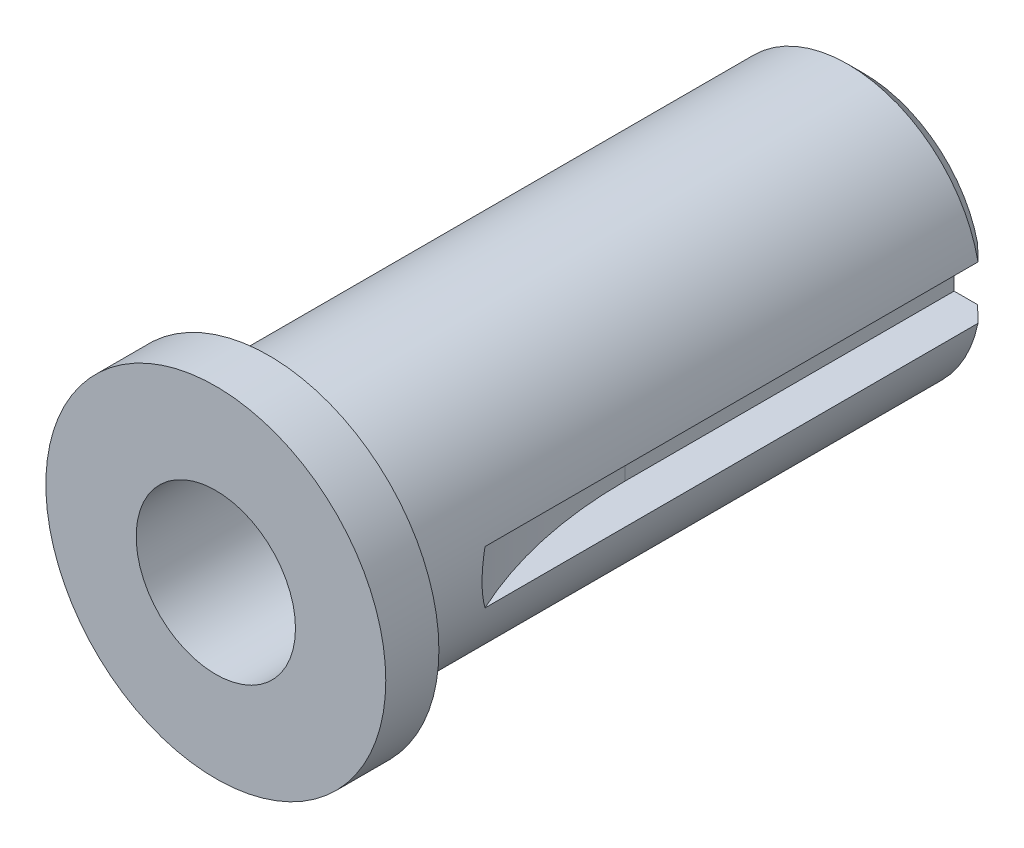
ISO-10303-21;
HEADER;
FILE_DESCRIPTION(('STEP AP214'),'2;1');
FILE_NAME('part.step','',(''),(''),'','','');
FILE_SCHEMA(('AUTOMOTIVE_DESIGN { 1 0 10303 214 1 1 1 1 }'));
ENDSEC;
DATA;
#1=APPLICATION_CONTEXT('core data for automotive mechanical design processes');
#2=APPLICATION_PROTOCOL_DEFINITION('international standard','automotive_design',2000,#1);
#3=PRODUCT_CONTEXT('',#1,'mechanical');
#4=PRODUCT('Part','Part','',(#3));
#5=PRODUCT_RELATED_PRODUCT_CATEGORY('part','',(#4));
#6=PRODUCT_DEFINITION_FORMATION('','',#4);
#7=PRODUCT_DEFINITION_CONTEXT('part definition',#1,'design');
#8=PRODUCT_DEFINITION('design','',#6,#7);
#9=PRODUCT_DEFINITION_SHAPE('','',#8);
#10=(LENGTH_UNIT() NAMED_UNIT(*) SI_UNIT(.MILLI.,.METRE.));
#11=(NAMED_UNIT(*) PLANE_ANGLE_UNIT() SI_UNIT($,.RADIAN.));
#12=(NAMED_UNIT(*) SI_UNIT($,.STERADIAN.) SOLID_ANGLE_UNIT());
#13=UNCERTAINTY_MEASURE_WITH_UNIT(LENGTH_MEASURE(1.E-05),#10,'distance_accuracy_value','');
#14=(GEOMETRIC_REPRESENTATION_CONTEXT(3) GLOBAL_UNCERTAINTY_ASSIGNED_CONTEXT((#13)) GLOBAL_UNIT_ASSIGNED_CONTEXT((#10,
#11,#12)) REPRESENTATION_CONTEXT('',''));
#15=CARTESIAN_POINT('',(0.,0.,0.));
#16=DIRECTION('',(0.,0.,1.));
#17=DIRECTION('',(1.,0.,0.));
#18=AXIS2_PLACEMENT_3D('',#15,#16,#17);
#19=CARTESIAN_POINT('',(0.,0.,56.));
#20=DIRECTION('',(0.,0.,-1.));
#21=DIRECTION('',(-1.,0.,0.));
#22=AXIS2_PLACEMENT_3D('',#19,#20,#21);
#23=CYLINDRICAL_SURFACE('',#22,12.5);
#24=CARTESIAN_POINT('',(12.2474487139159,-2.50000000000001,47.9042161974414));
#25=CARTESIAN_POINT('',(12.2771281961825,-2.35468268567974,47.9678597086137));
#26=CARTESIAN_POINT('',(12.3046364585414,-2.20664219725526,48.0264218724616));
#27=CARTESIAN_POINT('',(12.3547995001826,-1.90580453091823,48.1326588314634));
#28=CARTESIAN_POINT('',(12.377451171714,-1.75300437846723,48.1803266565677));
#29=CARTESIAN_POINT('',(12.4173191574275,-1.4437696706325,48.2639008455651));
#30=CARTESIAN_POINT('',(12.4345440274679,-1.28734125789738,48.2998257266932));
#31=CARTESIAN_POINT('',(12.4631838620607,-0.971673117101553,48.3594061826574));
#32=CARTESIAN_POINT('',(12.4746002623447,-0.812434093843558,48.3830647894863));
#33=CARTESIAN_POINT('',(12.4913699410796,-0.491533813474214,48.4177764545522));
#34=CARTESIAN_POINT('',(12.4966956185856,-0.32986486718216,48.4287721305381));
#35=CARTESIAN_POINT('',(12.5010470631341,-0.00608277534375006,48.4377582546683));
#36=CARTESIAN_POINT('',(12.5000728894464,0.156030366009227,48.4357488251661));
#37=CARTESIAN_POINT('',(12.4918517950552,0.479343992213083,48.4187643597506));
#38=CARTESIAN_POINT('',(12.4846077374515,0.640544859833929,48.4037952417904));
#39=CARTESIAN_POINT('',(12.4640531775,0.960804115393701,48.3611948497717));
#40=CARTESIAN_POINT('',(12.4507441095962,1.11986300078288,48.333566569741));
#41=CARTESIAN_POINT('',(12.4128736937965,1.48846530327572,48.254618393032));
#42=CARTESIAN_POINT('',(12.3860240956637,1.69675987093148,48.1984349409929));
#43=CARTESIAN_POINT('',(12.3389168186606,2.00295526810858,48.0990463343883));
#44=CARTESIAN_POINT('',(12.3220831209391,2.10394286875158,48.0634139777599));
#45=CARTESIAN_POINT('',(12.2863069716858,2.30367973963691,47.9873542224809));
#46=CARTESIAN_POINT('',(12.2673651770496,2.40242969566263,47.9469283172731));
#47=CARTESIAN_POINT('',(12.2474487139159,2.49999999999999,47.9042161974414));
#48=B_SPLINE_CURVE_WITH_KNOTS('',3,(#24,#25,#26,#27,#28,#29,#30,#31,#32,#33,#34,#35,#36,#37,#38,
#39,#40,#41,#42,#43,#44,#45,#46,#47),.UNSPECIFIED.,.F.,.F.,(4,2,2,2,2,2,2,2,2,2,2,4),(0.,
0.484143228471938,0.968595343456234,1.45227980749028,1.93584465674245,2.42159226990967,
2.90733531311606,3.39285666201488,3.87826323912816,4.52892981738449,4.8540210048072,
5.17901117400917),.UNSPECIFIED.);
#49=CARTESIAN_POINT('',(12.2474487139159,-2.50000000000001,47.9042161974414));
#50=VERTEX_POINT('',#49);
#51=CARTESIAN_POINT('',(12.2474487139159,2.49999999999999,47.9042161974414));
#52=VERTEX_POINT('',#51);
#53=EDGE_CURVE('E12',#50,#52,#48,.T.);
#54=ORIENTED_EDGE('',*,*,#53,.T.);
#55=DIRECTION('',(0.,0.,-1.));
#56=VECTOR('',#55,1.);
#57=CARTESIAN_POINT('',(12.2474487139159,2.49999999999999,56.));
#58=LINE('',#57,#56);
#59=CARTESIAN_POINT('',(12.2474487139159,2.49999999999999,1.5));
#60=VERTEX_POINT('',#59);
#61=EDGE_CURVE('E94',#52,#60,#58,.T.);
#62=ORIENTED_EDGE('',*,*,#61,.T.);
#63=CARTESIAN_POINT('',(0.,0.,1.5));
#64=DIRECTION('',(0.,0.,1.));
#65=DIRECTION('',(1.,0.,0.));
#66=AXIS2_PLACEMENT_3D('',#63,#64,#65);
#67=CIRCLE('',#66,12.5);
#68=CARTESIAN_POINT('',(12.2474487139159,-2.50000000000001,1.5));
#69=VERTEX_POINT('',#68);
#70=EDGE_CURVE('E141',#60,#69,#67,.T.);
#71=ORIENTED_EDGE('',*,*,#70,.T.);
#72=DIRECTION('',(0.,0.,-1.));
#73=VECTOR('',#72,1.);
#74=CARTESIAN_POINT('',(12.2474487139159,-2.50000000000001,56.));
#75=LINE('',#74,#73);
#76=EDGE_CURVE('E56',#50,#69,#75,.T.);
#77=ORIENTED_EDGE('',*,*,#76,.F.);
#78=EDGE_LOOP('',(#54,#62,#71,#77));
#79=FACE_BOUND('',#78,.T.);
#80=CARTESIAN_POINT('',(0.,0.,56.));
#81=DIRECTION('',(0.,0.,1.));
#82=DIRECTION('',(1.,0.,0.));
#83=AXIS2_PLACEMENT_3D('',#80,#81,#82);
#84=CIRCLE('',#83,12.5);
#85=CARTESIAN_POINT('',(12.5,0.,56.));
#86=VERTEX_POINT('',#85);
#87=EDGE_CURVE('E135',#86,#86,#84,.T.);
#88=ORIENTED_EDGE('',*,*,#87,.F.);
#89=EDGE_LOOP('',(#88));
#90=FACE_BOUND('',#89,.T.);
#91=ADVANCED_FACE('F36',(#79,#90),#23,.T.);
#92=CARTESIAN_POINT('',(0.,0.,0.));
#93=DIRECTION('',(0.,0.,1.));
#94=DIRECTION('',(1.,0.,0.));
#95=AXIS2_PLACEMENT_3D('',#92,#93,#94);
#96=PLANE('',#95);
#97=CARTESIAN_POINT('',(0.,0.,0.));
#98=DIRECTION('',(0.,0.,1.));
#99=DIRECTION('',(1.,0.,0.));
#100=AXIS2_PLACEMENT_3D('',#97,#98,#99);
#101=CIRCLE('',#100,11.);
#102=CARTESIAN_POINT('',(10.7121426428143,-2.50000000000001,0.));
#103=VERTEX_POINT('',#102);
#104=CARTESIAN_POINT('',(10.7121426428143,2.49999999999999,0.));
#105=VERTEX_POINT('',#104);
#106=EDGE_CURVE('E144',#103,#105,#101,.F.);
#107=ORIENTED_EDGE('',*,*,#106,.T.);
#108=DIRECTION('',(-1.,0.,0.));
#109=VECTOR('',#108,1.);
#110=CARTESIAN_POINT('',(0.,2.5,0.));
#111=LINE('',#110,#109);
#112=CARTESIAN_POINT('',(8.5,2.5,0.));
#113=VERTEX_POINT('',#112);
#114=EDGE_CURVE('E116',#105,#113,#111,.T.);
#115=ORIENTED_EDGE('',*,*,#114,.T.);
#116=DIRECTION('',(0.,-1.,0.));
#117=VECTOR('',#116,1.);
#118=CARTESIAN_POINT('',(8.5,0.,0.));
#119=LINE('',#118,#117);
#120=CARTESIAN_POINT('',(8.5,-2.5,0.));
#121=VERTEX_POINT('',#120);
#122=EDGE_CURVE('E49',#113,#121,#119,.T.);
#123=ORIENTED_EDGE('',*,*,#122,.T.);
#124=DIRECTION('',(-1.,0.,0.));
#125=VECTOR('',#124,1.);
#126=CARTESIAN_POINT('',(0.,-2.5,0.));
#127=LINE('',#126,#125);
#128=EDGE_CURVE('E106',#103,#121,#127,.T.);
#129=ORIENTED_EDGE('',*,*,#128,.F.);
#130=EDGE_LOOP('',(#107,#115,#123,#129));
#131=FACE_BOUND('',#130,.T.);
#132=CARTESIAN_POINT('',(0.,0.,0.));
#133=DIRECTION('',(0.,0.,1.));
#134=DIRECTION('',(1.,0.,0.));
#135=AXIS2_PLACEMENT_3D('',#132,#133,#134);
#136=CIRCLE('',#135,5.915);
#137=CARTESIAN_POINT('',(5.915,0.,0.));
#138=VERTEX_POINT('',#137);
#139=EDGE_CURVE('E120',#138,#138,#136,.T.);
#140=ORIENTED_EDGE('',*,*,#139,.T.);
#141=EDGE_LOOP('',(#140));
#142=FACE_BOUND('',#141,.T.);
#143=ADVANCED_FACE('F186',(#131,#142),#96,.F.);
#144=CARTESIAN_POINT('',(0.,0.,56.));
#145=DIRECTION('',(0.,0.,1.));
#146=DIRECTION('',(1.,0.,0.));
#147=AXIS2_PLACEMENT_3D('',#144,#145,#146);
#148=PLANE('',#147);
#149=CARTESIAN_POINT('',(0.,0.,56.));
#150=DIRECTION('',(0.,0.,1.));
#151=DIRECTION('',(1.,0.,0.));
#152=AXIS2_PLACEMENT_3D('',#149,#150,#151);
#153=CIRCLE('',#152,16.);
#154=CARTESIAN_POINT('',(16.,0.,56.));
#155=VERTEX_POINT('',#154);
#156=EDGE_CURVE('E131',#155,#155,#153,.T.);
#157=ORIENTED_EDGE('',*,*,#156,.F.);
#158=EDGE_LOOP('',(#157));
#159=FACE_BOUND('',#158,.T.);
#160=ORIENTED_EDGE('',*,*,#87,.T.);
#161=EDGE_LOOP('',(#160));
#162=FACE_BOUND('',#161,.T.);
#163=ADVANCED_FACE('F183',(#159,#162),#148,.F.);
#164=CARTESIAN_POINT('',(0.,0.,61.));
#165=DIRECTION('',(0.,0.,-1.));
#166=DIRECTION('',(-1.,0.,0.));
#167=AXIS2_PLACEMENT_3D('',#164,#165,#166);
#168=CYLINDRICAL_SURFACE('',#167,16.);
#169=CARTESIAN_POINT('',(0.,0.,61.));
#170=DIRECTION('',(0.,0.,1.));
#171=DIRECTION('',(1.,0.,0.));
#172=AXIS2_PLACEMENT_3D('',#169,#170,#171);
#173=CIRCLE('',#172,16.);
#174=CARTESIAN_POINT('',(16.,0.,61.));
#175=VERTEX_POINT('',#174);
#176=EDGE_CURVE('E132',#175,#175,#173,.T.);
#177=ORIENTED_EDGE('',*,*,#176,.F.);
#178=EDGE_LOOP('',(#177));
#179=FACE_BOUND('',#178,.T.);
#180=ORIENTED_EDGE('',*,*,#156,.T.);
#181=EDGE_LOOP('',(#180));
#182=FACE_BOUND('',#181,.T.);
#183=ADVANCED_FACE('F181',(#179,#182),#168,.T.);
#184=CARTESIAN_POINT('',(0.,0.,61.));
#185=DIRECTION('',(0.,0.,1.));
#186=DIRECTION('',(1.,0.,0.));
#187=AXIS2_PLACEMENT_3D('',#184,#185,#186);
#188=PLANE('',#187);
#189=CARTESIAN_POINT('',(0.,0.,61.));
#190=DIRECTION('',(0.,0.,1.));
#191=DIRECTION('',(1.,0.,0.));
#192=AXIS2_PLACEMENT_3D('',#189,#190,#191);
#193=CIRCLE('',#192,7.5);
#194=CARTESIAN_POINT('',(7.5,0.,61.));
#195=VERTEX_POINT('',#194);
#196=EDGE_CURVE('E123',#195,#195,#193,.T.);
#197=ORIENTED_EDGE('',*,*,#196,.F.);
#198=EDGE_LOOP('',(#197));
#199=FACE_BOUND('',#198,.T.);
#200=ORIENTED_EDGE('',*,*,#176,.T.);
#201=EDGE_LOOP('',(#200));
#202=FACE_BOUND('',#201,.T.);
#203=ADVANCED_FACE('F177',(#199,#202),#188,.T.);
#204=CARTESIAN_POINT('',(0.,0.,-21.2132034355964));
#205=DIRECTION('',(0.,0.,1.));
#206=DIRECTION('',(1.,0.,0.));
#207=AXIS2_PLACEMENT_3D('',#204,#205,#206);
#208=CYLINDRICAL_SURFACE('',#207,7.5);
#209=CARTESIAN_POINT('',(0.,0.,25.));
#210=DIRECTION('',(0.,0.,1.));
#211=DIRECTION('',(1.,0.,0.));
#212=AXIS2_PLACEMENT_3D('',#209,#210,#211);
#213=CIRCLE('',#212,7.5);
#214=CARTESIAN_POINT('',(7.5,0.,25.));
#215=VERTEX_POINT('',#214);
#216=EDGE_CURVE('E128',#215,#215,#213,.F.);
#217=ORIENTED_EDGE('',*,*,#216,.T.);
#218=EDGE_LOOP('',(#217));
#219=FACE_BOUND('',#218,.T.);
#220=ORIENTED_EDGE('',*,*,#196,.T.);
#221=EDGE_LOOP('',(#220));
#222=FACE_BOUND('',#221,.T.);
#223=ADVANCED_FACE('F173',(#219,#222),#208,.F.);
#224=CARTESIAN_POINT('',(0.,0.,25.));
#225=DIRECTION('',(0.,0.,1.));
#226=DIRECTION('',(1.,0.,0.));
#227=AXIS2_PLACEMENT_3D('',#224,#225,#226);
#228=PLANE('',#227);
#229=CARTESIAN_POINT('',(0.,0.,25.));
#230=DIRECTION('',(0.,0.,1.));
#231=DIRECTION('',(1.,0.,0.));
#232=AXIS2_PLACEMENT_3D('',#229,#230,#231);
#233=CIRCLE('',#232,5.915);
#234=CARTESIAN_POINT('',(5.915,0.,25.));
#235=VERTEX_POINT('',#234);
#236=EDGE_CURVE('E119',#235,#235,#233,.T.);
#237=ORIENTED_EDGE('',*,*,#236,.F.);
#238=EDGE_LOOP('',(#237));
#239=FACE_BOUND('',#238,.T.);
#240=ORIENTED_EDGE('',*,*,#216,.F.);
#241=EDGE_LOOP('',(#240));
#242=FACE_BOUND('',#241,.T.);
#243=ADVANCED_FACE('F169',(#239,#242),#228,.T.);
#244=CARTESIAN_POINT('',(0.,0.,0.));
#245=DIRECTION('',(0.,0.,1.));
#246=DIRECTION('',(1.,0.,0.));
#247=AXIS2_PLACEMENT_3D('',#244,#245,#246);
#248=CYLINDRICAL_SURFACE('',#247,5.915);
#249=ORIENTED_EDGE('',*,*,#139,.F.);
#250=EDGE_LOOP('',(#249));
#251=FACE_BOUND('',#250,.T.);
#252=ORIENTED_EDGE('',*,*,#236,.T.);
#253=EDGE_LOOP('',(#252));
#254=FACE_BOUND('',#253,.T.);
#255=ADVANCED_FACE('F166',(#251,#254),#248,.F.);
#256=CARTESIAN_POINT('',(0.,0.,1.5));
#257=DIRECTION('',(0.,0.,1.));
#258=DIRECTION('',(1.,0.,0.));
#259=AXIS2_PLACEMENT_3D('',#256,#257,#258);
#260=CONICAL_SURFACE('',#259,12.5,0.785398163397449);
#261=CARTESIAN_POINT('',(5.07867915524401,2.5,-5.33934792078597));
#262=CARTESIAN_POINT('',(5.28442984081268,2.5,-5.15468284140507));
#263=CARTESIAN_POINT('',(5.48915692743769,2.5,-4.96888696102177));
#264=CARTESIAN_POINT('',(5.89697528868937,2.5,-4.59551868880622));
#265=CARTESIAN_POINT('',(6.10006660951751,2.5,-4.40794634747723));
#266=CARTESIAN_POINT('',(6.5050231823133,2.5,-4.03151204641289));
#267=CARTESIAN_POINT('',(6.7068885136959,2.5,-3.842650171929));
#268=CARTESIAN_POINT('',(7.10966592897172,2.5,-3.46390990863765));
#269=CARTESIAN_POINT('',(7.31057800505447,2.5,-3.2740315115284));
#270=CARTESIAN_POINT('',(7.91215017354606,2.5,-2.70325516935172));
#271=CARTESIAN_POINT('',(8.31168906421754,2.5,-2.32117604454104));
#272=CARTESIAN_POINT('',(9.10881196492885,2.5,-1.55497623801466));
#273=CARTESIAN_POINT('',(9.50639594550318,2.49999999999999,-1.17085552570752));
#274=CARTESIAN_POINT('',(10.1255626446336,2.49999999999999,-0.570518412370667));
#275=CARTESIAN_POINT('',(10.3476162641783,2.49999999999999,-0.354787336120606));
#276=CARTESIAN_POINT('',(10.7913663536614,2.49999999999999,0.077047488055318));
#277=CARTESIAN_POINT('',(11.0130628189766,2.49999999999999,0.293151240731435));
#278=CARTESIAN_POINT('',(11.740952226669,2.49999999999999,1.00365753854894));
#279=CARTESIAN_POINT('',(12.2465154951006,2.49999999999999,1.49870513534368));
#280=CARTESIAN_POINT('',(13.2565687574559,2.49999999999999,2.48989441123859));
#281=CARTESIAN_POINT('',(13.7610587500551,2.49999999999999,2.98603609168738));
#282=CARTESIAN_POINT('',(14.7692373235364,2.49999999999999,3.97907730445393));
#283=CARTESIAN_POINT('',(15.2729259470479,2.49999999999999,4.47597679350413));
#284=CARTESIAN_POINT('',(16.2797133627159,2.49999999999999,5.47036959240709));
#285=CARTESIAN_POINT('',(16.7828121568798,2.49999999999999,5.96786290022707));
#286=CARTESIAN_POINT('',(17.2857096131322,2.49999999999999,6.46555916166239));
#287=B_SPLINE_CURVE_WITH_KNOTS('',3,(#261,#262,#263,#264,#265,#266,#267,#268,#269,#270,#271,
#272,#273,#274,#275,#276,#277,#278,#279,#280,#281,#282,#283,#284,#285,#286),.UNSPECIFIED.,.F.,
.F.,(4,2,2,2,2,2,2,2,2,2,2,2,4),(0.,0.829390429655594,1.65875735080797,2.48806996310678,
3.31738935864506,4.97585222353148,6.63434000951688,7.56311801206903,8.49190794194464,
10.6146385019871,12.7373716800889,14.8599878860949,16.9825968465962),.UNSPECIFIED.);
#288=EDGE_CURVE('E64',#105,#60,#287,.T.);
#289=ORIENTED_EDGE('',*,*,#288,.F.);
#290=ORIENTED_EDGE('',*,*,#106,.F.);
#291=CARTESIAN_POINT('',(5.07867915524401,-2.5,-5.33934792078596));
#292=CARTESIAN_POINT('',(5.28442984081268,-2.5,-5.15468284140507));
#293=CARTESIAN_POINT('',(5.4891569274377,-2.5,-4.96888696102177));
#294=CARTESIAN_POINT('',(5.89697528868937,-2.5,-4.59551868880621));
#295=CARTESIAN_POINT('',(6.10006660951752,-2.5,-4.40794634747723));
#296=CARTESIAN_POINT('',(6.50502318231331,-2.5,-4.03151204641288));
#297=CARTESIAN_POINT('',(6.70688851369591,-2.5,-3.84265017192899));
#298=CARTESIAN_POINT('',(7.10966592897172,-2.5,-3.46390990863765));
#299=CARTESIAN_POINT('',(7.31057800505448,-2.5,-3.2740315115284));
#300=CARTESIAN_POINT('',(7.91215017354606,-2.5,-2.70325516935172));
#301=CARTESIAN_POINT('',(8.31168906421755,-2.5,-2.32117604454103));
#302=CARTESIAN_POINT('',(9.10881196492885,-2.5,-1.55497623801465));
#303=CARTESIAN_POINT('',(9.50639594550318,-2.50000000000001,-1.17085552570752));
#304=CARTESIAN_POINT('',(10.1255626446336,-2.50000000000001,-0.570518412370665));
#305=CARTESIAN_POINT('',(10.3476162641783,-2.50000000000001,-0.354787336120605));
#306=CARTESIAN_POINT('',(10.7913663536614,-2.50000000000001,0.0770474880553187));
#307=CARTESIAN_POINT('',(11.0130628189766,-2.50000000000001,0.293151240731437));
#308=CARTESIAN_POINT('',(11.740952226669,-2.50000000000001,1.00365753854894));
#309=CARTESIAN_POINT('',(12.2465154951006,-2.50000000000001,1.49870513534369));
#310=CARTESIAN_POINT('',(13.2565687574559,-2.50000000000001,2.4898944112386));
#311=CARTESIAN_POINT('',(13.7610587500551,-2.50000000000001,2.98603609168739));
#312=CARTESIAN_POINT('',(14.7692373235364,-2.50000000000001,3.97907730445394));
#313=CARTESIAN_POINT('',(15.2729259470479,-2.50000000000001,4.47597679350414));
#314=CARTESIAN_POINT('',(16.2797133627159,-2.50000000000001,5.4703695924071));
#315=CARTESIAN_POINT('',(16.7828121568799,-2.50000000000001,5.96786290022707));
#316=CARTESIAN_POINT('',(17.2857096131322,-2.50000000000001,6.46555916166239));
#317=B_SPLINE_CURVE_WITH_KNOTS('',3,(#291,#292,#293,#294,#295,#296,#297,#298,#299,#300,#301,
#302,#303,#304,#305,#306,#307,#308,#309,#310,#311,#312,#313,#314,#315,#316),.UNSPECIFIED.,.F.,
.F.,(4,2,2,2,2,2,2,2,2,2,2,2,4),(0.,0.829390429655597,1.65875735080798,2.48806996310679,
3.31738935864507,4.97585222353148,6.63434000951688,7.56311801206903,8.49190794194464,
10.6146385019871,12.7373716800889,14.8599878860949,16.9825968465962),.UNSPECIFIED.);
#318=EDGE_CURVE('E147',#103,#69,#317,.T.);
#319=ORIENTED_EDGE('',*,*,#318,.T.);
#320=ORIENTED_EDGE('',*,*,#70,.F.);
#321=EDGE_LOOP('',(#289,#290,#319,#320));
#322=FACE_BOUND('',#321,.T.);
#323=ADVANCED_FACE('F38',(#322),#260,.T.);
#324=CARTESIAN_POINT('',(48.5,2.49999999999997,31.));
#325=DIRECTION('',(0.,-1.,0.));
#326=DIRECTION('',(1.,0.,0.));
#327=AXIS2_PLACEMENT_3D('',#324,#325,#326);
#328=CYLINDRICAL_SURFACE('',#327,40.);
#329=CARTESIAN_POINT('',(48.5,-2.50000000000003,31.));
#330=DIRECTION('',(0.,-1.,0.));
#331=DIRECTION('',(-1.,0.,0.));
#332=AXIS2_PLACEMENT_3D('',#329,#330,#331);
#333=CIRCLE('',#332,40.);
#334=CARTESIAN_POINT('',(8.5,-2.5,31.));
#335=VERTEX_POINT('',#334);
#336=EDGE_CURVE('E102',#50,#335,#333,.T.);
#337=ORIENTED_EDGE('',*,*,#336,.T.);
#338=DIRECTION('',(0.,-1.,0.));
#339=VECTOR('',#338,1.);
#340=CARTESIAN_POINT('',(8.5,2.5,31.));
#341=LINE('',#340,#339);
#342=CARTESIAN_POINT('',(8.5,2.5,31.));
#343=VERTEX_POINT('',#342);
#344=EDGE_CURVE('E100',#343,#335,#341,.T.);
#345=ORIENTED_EDGE('',*,*,#344,.F.);
#346=CARTESIAN_POINT('',(48.5,2.49999999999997,31.));
#347=DIRECTION('',(0.,-1.,0.));
#348=DIRECTION('',(-1.,0.,0.));
#349=AXIS2_PLACEMENT_3D('',#346,#347,#348);
#350=CIRCLE('',#349,40.);
#351=EDGE_CURVE('E88',#52,#343,#350,.T.);
#352=ORIENTED_EDGE('',*,*,#351,.F.);
#353=ORIENTED_EDGE('',*,*,#53,.F.);
#354=EDGE_LOOP('',(#337,#345,#352,#353));
#355=FACE_BOUND('',#354,.T.);
#356=ADVANCED_FACE('F101',(#355),#328,.F.);
#357=CARTESIAN_POINT('',(8.5,2.5,31.));
#358=DIRECTION('',(-1.,0.,0.));
#359=DIRECTION('',(0.,-1.,0.));
#360=AXIS2_PLACEMENT_3D('',#357,#358,#359);
#361=PLANE('',#360);
#362=DIRECTION('',(0.,0.,-1.));
#363=VECTOR('',#362,1.);
#364=CARTESIAN_POINT('',(8.5,2.5,31.));
#365=LINE('',#364,#363);
#366=EDGE_CURVE('E92',#343,#113,#365,.T.);
#367=ORIENTED_EDGE('',*,*,#366,.F.);
#368=ORIENTED_EDGE('',*,*,#344,.T.);
#369=DIRECTION('',(0.,0.,-1.));
#370=VECTOR('',#369,1.);
#371=CARTESIAN_POINT('',(8.5,-2.5,31.));
#372=LINE('',#371,#370);
#373=EDGE_CURVE('E97',#335,#121,#372,.T.);
#374=ORIENTED_EDGE('',*,*,#373,.T.);
#375=ORIENTED_EDGE('',*,*,#122,.F.);
#376=EDGE_LOOP('',(#367,#368,#374,#375));
#377=FACE_BOUND('',#376,.T.);
#378=ADVANCED_FACE('F108',(#377),#361,.F.);
#379=CARTESIAN_POINT('',(48.5,2.49999999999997,31.));
#380=DIRECTION('',(0.,1.,0.));
#381=DIRECTION('',(-1.,0.,0.));
#382=AXIS2_PLACEMENT_3D('',#379,#380,#381);
#383=PLANE('',#382);
#384=ORIENTED_EDGE('',*,*,#351,.T.);
#385=ORIENTED_EDGE('',*,*,#366,.T.);
#386=ORIENTED_EDGE('',*,*,#114,.F.);
#387=ORIENTED_EDGE('',*,*,#288,.T.);
#388=ORIENTED_EDGE('',*,*,#61,.F.);
#389=EDGE_LOOP('',(#384,#385,#386,#387,#388));
#390=FACE_BOUND('',#389,.T.);
#391=ADVANCED_FACE('F90',(#390),#383,.F.);
#392=CARTESIAN_POINT('',(48.5,-2.50000000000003,31.));
#393=DIRECTION('',(0.,1.,0.));
#394=DIRECTION('',(-1.,0.,0.));
#395=AXIS2_PLACEMENT_3D('',#392,#393,#394);
#396=PLANE('',#395);
#397=ORIENTED_EDGE('',*,*,#76,.T.);
#398=ORIENTED_EDGE('',*,*,#318,.F.);
#399=ORIENTED_EDGE('',*,*,#128,.T.);
#400=ORIENTED_EDGE('',*,*,#373,.F.);
#401=ORIENTED_EDGE('',*,*,#336,.F.);
#402=EDGE_LOOP('',(#397,#398,#399,#400,#401));
#403=FACE_BOUND('',#402,.T.);
#404=ADVANCED_FACE('F157',(#403),#396,.T.);
#405=CLOSED_SHELL('',(#91,#143,#163,#183,#203,#223,#243,#255,#323,#356,#378,#391,#404));
#406=MANIFOLD_SOLID_BREP('B2',#405);
#407=ADVANCED_BREP_SHAPE_REPRESENTATION('',(#18,#406),#14);
#408=SHAPE_DEFINITION_REPRESENTATION(#9,#407);
ENDSEC;
END-ISO-10303-21;
